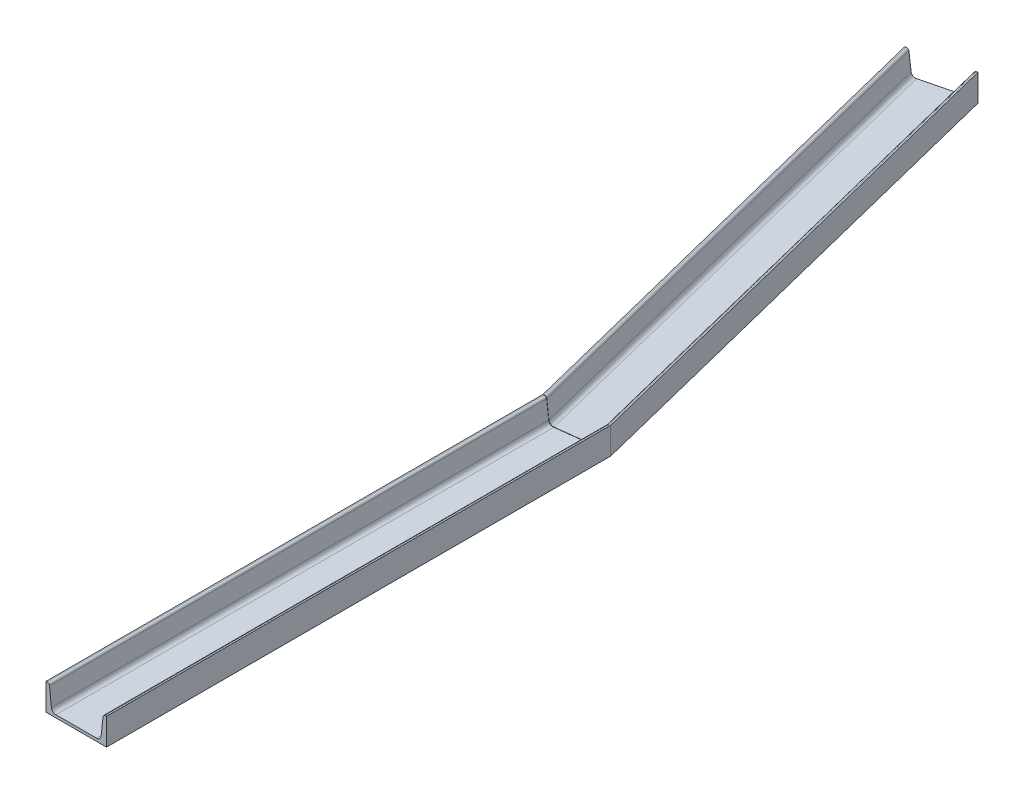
ISO-10303-21;
HEADER;
FILE_DESCRIPTION(('STEP AP214'),'2;1');
FILE_NAME('part.step','',(''),(''),'','','');
FILE_SCHEMA(('AUTOMOTIVE_DESIGN { 1 0 10303 214 1 1 1 1 }'));
ENDSEC;
DATA;
#1=APPLICATION_CONTEXT('core data for automotive mechanical design processes');
#2=APPLICATION_PROTOCOL_DEFINITION('international standard','automotive_design',2000,#1);
#3=PRODUCT_CONTEXT('',#1,'mechanical');
#4=PRODUCT('Part','Part','',(#3));
#5=PRODUCT_RELATED_PRODUCT_CATEGORY('part','',(#4));
#6=PRODUCT_DEFINITION_FORMATION('','',#4);
#7=PRODUCT_DEFINITION_CONTEXT('part definition',#1,'design');
#8=PRODUCT_DEFINITION('design','',#6,#7);
#9=PRODUCT_DEFINITION_SHAPE('','',#8);
#10=(LENGTH_UNIT() NAMED_UNIT(*) SI_UNIT(.MILLI.,.METRE.));
#11=(NAMED_UNIT(*) PLANE_ANGLE_UNIT() SI_UNIT($,.RADIAN.));
#12=(NAMED_UNIT(*) SI_UNIT($,.STERADIAN.) SOLID_ANGLE_UNIT());
#13=UNCERTAINTY_MEASURE_WITH_UNIT(LENGTH_MEASURE(1.E-05),#10,'distance_accuracy_value','');
#14=(GEOMETRIC_REPRESENTATION_CONTEXT(3) GLOBAL_UNCERTAINTY_ASSIGNED_CONTEXT((#13)) GLOBAL_UNIT_ASSIGNED_CONTEXT((#10,
#11,#12)) REPRESENTATION_CONTEXT('',''));
#15=CARTESIAN_POINT('',(0.,0.,0.));
#16=DIRECTION('',(0.,0.,1.));
#17=DIRECTION('',(1.,0.,0.));
#18=AXIS2_PLACEMENT_3D('',#15,#16,#17);
#19=CARTESIAN_POINT('',(-57.5511778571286,53.,1000.));
#20=DIRECTION('',(0.,-1.,0.));
#21=DIRECTION('',(0.,0.,-1.));
#22=AXIS2_PLACEMENT_3D('',#19,#20,#21);
#23=PLANE('',#22);
#24=DIRECTION('',(0.992546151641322,0.,-0.121869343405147));
#25=VECTOR('',#24,1.);
#26=CARTESIAN_POINT('',(-176.796706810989,53.,28.8231022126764));
#27=LINE('',#26,#25);
#28=CARTESIAN_POINT('',(-60.0609346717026,53.,14.4897516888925));
#29=VERTEX_POINT('',#28);
#30=CARTESIAN_POINT('',(-57.612112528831,53.0000000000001,14.1890741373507));
#31=VERTEX_POINT('',#30);
#32=EDGE_CURVE('E258',#29,#31,#27,.T.);
#33=ORIENTED_EDGE('',*,*,#32,.T.);
#34=DIRECTION('',(0.241921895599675,0.,0.970295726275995));
#35=VECTOR('',#34,1.);
#36=CARTESIAN_POINT('',(-295.981301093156,53.0000000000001,-941.857522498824));
#37=LINE('',#36,#35);
#38=CARTESIAN_POINT('',(-295.981301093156,53.0000000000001,-941.857522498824));
#39=VERTEX_POINT('',#38);
#40=EDGE_CURVE('E315',#39,#31,#37,.T.);
#41=ORIENTED_EDGE('',*,*,#40,.F.);
#42=DIRECTION('',(0.970295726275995,0.,-0.241921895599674));
#43=VECTOR('',#42,1.);
#44=CARTESIAN_POINT('',(-295.981301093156,53.0000000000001,-941.857522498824));
#45=LINE('',#44,#43);
#46=CARTESIAN_POINT('',(-298.357382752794,53.0000000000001,-941.265098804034));
#47=VERTEX_POINT('',#46);
#48=EDGE_CURVE('E272',#47,#39,#45,.T.);
#49=ORIENTED_EDGE('',*,*,#48,.F.);
#50=DIRECTION('',(0.241921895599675,0.,0.970295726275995));
#51=VECTOR('',#50,1.);
#52=CARTESIAN_POINT('',(-298.357382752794,53.0000000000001,-941.265098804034));
#53=LINE('',#52,#51);
#54=EDGE_CURVE('E317',#47,#29,#53,.T.);
#55=ORIENTED_EDGE('',*,*,#54,.T.);
#56=EDGE_LOOP('',(#33,#41,#49,#55));
#57=FACE_BOUND('',#56,.T.);
#58=ADVANCED_FACE('F39',(#57),#23,.F.);
#59=CARTESIAN_POINT('',(40.3976442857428,5.5,1000.));
#60=DIRECTION('',(0.,-1.,0.));
#61=DIRECTION('',(1.,0.,0.));
#62=AXIS2_PLACEMENT_3D('',#59,#60,#61);
#63=PLANE('',#62);
#64=DIRECTION('',(0.,0.,-1.));
#65=VECTOR('',#64,1.);
#66=CARTESIAN_POINT('',(40.3976442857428,5.5,1000.));
#67=LINE('',#66,#65);
#68=CARTESIAN_POINT('',(40.3976442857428,5.5,1000.));
#69=VERTEX_POINT('',#68);
#70=CARTESIAN_POINT('',(40.3976442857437,5.5,2.65874409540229));
#71=VERTEX_POINT('',#70);
#72=EDGE_CURVE('E359',#69,#71,#67,.T.);
#73=ORIENTED_EDGE('',*,*,#72,.T.);
#74=DIRECTION('',(-0.992546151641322,0.,0.121869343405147));
#75=VECTOR('',#74,1.);
#76=CARTESIAN_POINT('',(-80.2416993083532,5.49999999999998,17.471392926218));
#77=LINE('',#76,#75);
#78=CARTESIAN_POINT('',(-40.3976442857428,5.49999999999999,12.5791581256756));
#79=VERTEX_POINT('',#78);
#80=EDGE_CURVE('E231',#71,#79,#77,.T.);
#81=ORIENTED_EDGE('',*,*,#80,.T.);
#82=DIRECTION('',(0.,0.,-1.));
#83=VECTOR('',#82,1.);
#84=CARTESIAN_POINT('',(-40.3976442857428,5.49999999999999,1000.));
#85=LINE('',#84,#83);
#86=CARTESIAN_POINT('',(-40.3976442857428,5.49999999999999,1000.));
#87=VERTEX_POINT('',#86);
#88=EDGE_CURVE('E357',#87,#79,#85,.T.);
#89=ORIENTED_EDGE('',*,*,#88,.F.);
#90=DIRECTION('',(-1.,0.,0.));
#91=VECTOR('',#90,1.);
#92=CARTESIAN_POINT('',(40.3976442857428,5.5,1000.));
#93=LINE('',#92,#91);
#94=EDGE_CURVE('E342',#69,#87,#93,.T.);
#95=ORIENTED_EDGE('',*,*,#94,.F.);
#96=EDGE_LOOP('',(#73,#81,#89,#95));
#97=FACE_BOUND('',#96,.T.);
#98=ADVANCED_FACE('F450',(#97),#63,.F.);
#99=DIRECTION('',(0.,0.,-1.));
#100=VECTOR('',#99,1.);
#101=CARTESIAN_POINT('',(-57.5511778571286,53.,1000.));
#102=LINE('',#101,#100);
#103=CARTESIAN_POINT('',(-57.5511778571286,53.,1000.));
#104=VERTEX_POINT('',#103);
#105=CARTESIAN_POINT('',(-57.5511778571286,53.,14.6853472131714));
#106=VERTEX_POINT('',#105);
#107=EDGE_CURVE('E210',#104,#106,#102,.T.);
#108=ORIENTED_EDGE('',*,*,#107,.T.);
#109=DIRECTION('',(-0.992546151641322,0.,0.121869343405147));
#110=VECTOR('',#109,1.);
#111=CARTESIAN_POINT('',(-176.735772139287,53.,29.3193752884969));
#112=LINE('',#111,#110);
#113=CARTESIAN_POINT('',(-60.,53.,14.9860247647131));
#114=VERTEX_POINT('',#113);
#115=EDGE_CURVE('E214',#106,#114,#112,.T.);
#116=ORIENTED_EDGE('',*,*,#115,.T.);
#117=DIRECTION('',(0.,0.,-1.));
#118=VECTOR('',#117,1.);
#119=CARTESIAN_POINT('',(-60.,53.,1000.));
#120=LINE('',#119,#118);
#121=CARTESIAN_POINT('',(-60.,53.,1000.));
#122=VERTEX_POINT('',#121);
#123=EDGE_CURVE('E217',#122,#114,#120,.T.);
#124=ORIENTED_EDGE('',*,*,#123,.F.);
#125=DIRECTION('',(-1.,0.,0.));
#126=VECTOR('',#125,1.);
#127=CARTESIAN_POINT('',(-57.5511778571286,53.,1000.));
#128=LINE('',#127,#126);
#129=EDGE_CURVE('E216',#104,#122,#128,.T.);
#130=ORIENTED_EDGE('',*,*,#129,.F.);
#131=EDGE_LOOP('',(#108,#116,#124,#130));
#132=FACE_BOUND('',#131,.T.);
#133=ADVANCED_FACE('F211',(#132),#23,.F.);
#134=CARTESIAN_POINT('',(-60.,53.,1000.));
#135=DIRECTION('',(1.,0.,0.));
#136=DIRECTION('',(0.,1.,0.));
#137=AXIS2_PLACEMENT_3D('',#134,#135,#136);
#138=PLANE('',#137);
#139=ORIENTED_EDGE('',*,*,#123,.T.);
#140=DIRECTION('',(0.,-1.,0.));
#141=VECTOR('',#140,1.);
#142=CARTESIAN_POINT('',(-60.,53.,14.9860247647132));
#143=LINE('',#142,#141);
#144=CARTESIAN_POINT('',(-60.,0.,14.9860247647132));
#145=VERTEX_POINT('',#144);
#146=EDGE_CURVE('E229',#114,#145,#143,.T.);
#147=ORIENTED_EDGE('',*,*,#146,.T.);
#148=DIRECTION('',(0.,0.,-1.));
#149=VECTOR('',#148,1.);
#150=CARTESIAN_POINT('',(-60.,0.,1000.));
#151=LINE('',#150,#149);
#152=CARTESIAN_POINT('',(-60.,0.,1000.));
#153=VERTEX_POINT('',#152);
#154=EDGE_CURVE('E376',#153,#145,#151,.T.);
#155=ORIENTED_EDGE('',*,*,#154,.F.);
#156=DIRECTION('',(0.,-1.,0.));
#157=VECTOR('',#156,1.);
#158=CARTESIAN_POINT('',(-60.,53.,1000.));
#159=LINE('',#158,#157);
#160=EDGE_CURVE('E327',#122,#153,#159,.T.);
#161=ORIENTED_EDGE('',*,*,#160,.F.);
#162=EDGE_LOOP('',(#139,#147,#155,#161));
#163=FACE_BOUND('',#162,.T.);
#164=ADVANCED_FACE('F41',(#163),#138,.F.);
#165=CARTESIAN_POINT('',(57.5511778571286,48.5,1000.));
#166=DIRECTION('',(0.,0.,-1.));
#167=DIRECTION('',(-1.,0.,0.));
#168=AXIS2_PLACEMENT_3D('',#165,#166,#167);
#169=CYLINDRICAL_SURFACE('',#168,4.5);
#170=DIRECTION('',(0.,0.,-1.));
#171=VECTOR('',#170,1.);
#172=CARTESIAN_POINT('',(57.5511778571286,53.,1000.));
#173=LINE('',#172,#171);
#174=CARTESIAN_POINT('',(57.5511778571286,53.,1000.));
#175=VERTEX_POINT('',#174);
#176=CARTESIAN_POINT('',(57.5511778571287,53.0000000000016,0.300677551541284));
#177=VERTEX_POINT('',#176);
#178=EDGE_CURVE('E368',#175,#177,#173,.T.);
#179=ORIENTED_EDGE('',*,*,#178,.T.);
#180=CARTESIAN_POINT('',(57.5511778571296,48.5,0.300677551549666));
#181=DIRECTION('',(-0.121869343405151,0.,-0.992546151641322));
#182=DIRECTION('',(0.992546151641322,0.,-0.121869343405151));
#183=AXIS2_PLACEMENT_3D('',#180,#181,#182);
#184=ELLIPSE('',#183,4.53379421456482,4.5);
#185=CARTESIAN_POINT('',(55.4758177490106,52.4928536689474,0.555499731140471));
#186=VERTEX_POINT('',#185);
#187=EDGE_CURVE('E323',#186,#177,#184,.T.);
#188=ORIENTED_EDGE('',*,*,#187,.F.);
#189=CARTESIAN_POINT('',(57.5511778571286,48.5,17.4579514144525));
#190=DIRECTION('',(0.992546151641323,0.,-0.121869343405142));
#191=DIRECTION('',(-0.121869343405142,0.,-0.992546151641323));
#192=AXIS2_PLACEMENT_3D('',#189,#190,#191);
#193=ELLIPSE('',#192,36.9247907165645,4.5);
#194=CARTESIAN_POINT('',(55.5062850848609,52.5085425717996,0.803636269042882));
#195=VERTEX_POINT('',#194);
#196=EDGE_CURVE('E264',#186,#195,#193,.T.);
#197=ORIENTED_EDGE('',*,*,#196,.T.);
#198=CARTESIAN_POINT('',(57.5511778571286,48.5,0.552555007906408));
#199=DIRECTION('',(0.121869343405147,0.,0.992546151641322));
#200=DIRECTION('',(0.992546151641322,0.,-0.121869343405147));
#201=AXIS2_PLACEMENT_3D('',#198,#199,#200);
#202=ELLIPSE('',#201,4.53379421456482,4.5);
#203=CARTESIAN_POINT('',(53.0759033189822,48.9710815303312,1.10204962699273));
#204=VERTEX_POINT('',#203);
#205=EDGE_CURVE('E246',#195,#204,#202,.T.);
#206=ORIENTED_EDGE('',*,*,#205,.T.);
#207=DIRECTION('',(0.,0.,-1.));
#208=VECTOR('',#207,1.);
#209=CARTESIAN_POINT('',(53.0759033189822,48.9710815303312,1000.));
#210=LINE('',#209,#208);
#211=CARTESIAN_POINT('',(53.0759033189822,48.9710815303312,1000.));
#212=VERTEX_POINT('',#211);
#213=EDGE_CURVE('E365',#212,#204,#210,.T.);
#214=ORIENTED_EDGE('',*,*,#213,.F.);
#215=CARTESIAN_POINT('',(57.5511778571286,48.5,1000.));
#216=DIRECTION('',(0.,0.,1.));
#217=DIRECTION('',(1.,0.,0.));
#218=AXIS2_PLACEMENT_3D('',#215,#216,#217);
#219=CIRCLE('',#218,4.5);
#220=EDGE_CURVE('E336',#175,#212,#219,.T.);
#221=ORIENTED_EDGE('',*,*,#220,.F.);
#222=EDGE_LOOP('',(#179,#188,#197,#206,#214,#221));
#223=FACE_BOUND('',#222,.T.);
#224=ADVANCED_FACE('F462',(#223),#169,.T.);
#225=CARTESIAN_POINT('',(53.0759033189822,48.9710815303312,1000.));
#226=DIRECTION('',(0.994505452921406,-0.104684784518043,0.));
#227=DIRECTION('',(0.104684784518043,0.994505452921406,0.));
#228=AXIS2_PLACEMENT_3D('',#225,#226,#227);
#229=PLANE('',#228);
#230=ORIENTED_EDGE('',*,*,#213,.T.);
#231=DIRECTION('',(-0.104676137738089,-0.994423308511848,0.0128526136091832));
#232=VECTOR('',#231,1.);
#233=CARTESIAN_POINT('',(51.7320240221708,36.2042282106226,1.26705725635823));
#234=LINE('',#233,#232);
#235=CARTESIAN_POINT('',(49.3481933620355,13.5578369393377,1.55975485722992));
#236=VERTEX_POINT('',#235);
#237=EDGE_CURVE('E243',#204,#236,#234,.T.);
#238=ORIENTED_EDGE('',*,*,#237,.T.);
#239=DIRECTION('',(0.,0.,-1.));
#240=VECTOR('',#239,1.);
#241=CARTESIAN_POINT('',(49.3481933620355,13.5578369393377,1000.));
#242=LINE('',#241,#240);
#243=CARTESIAN_POINT('',(49.3481933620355,13.5578369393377,1000.));
#244=VERTEX_POINT('',#243);
#245=EDGE_CURVE('E362',#244,#236,#242,.T.);
#246=ORIENTED_EDGE('',*,*,#245,.F.);
#247=DIRECTION('',(-0.104684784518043,-0.994505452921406,0.));
#248=VECTOR('',#247,1.);
#249=CARTESIAN_POINT('',(53.0759033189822,48.9710815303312,1000.));
#250=LINE('',#249,#248);
#251=EDGE_CURVE('E338',#212,#244,#250,.T.);
#252=ORIENTED_EDGE('',*,*,#251,.F.);
#253=EDGE_LOOP('',(#230,#238,#246,#252));
#254=FACE_BOUND('',#253,.T.);
#255=ADVANCED_FACE('F457',(#254),#229,.F.);
#256=CARTESIAN_POINT('',(40.3976442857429,14.5,1000.));
#257=DIRECTION('',(0.,0.,-1.));
#258=DIRECTION('',(-1.,0.,0.));
#259=AXIS2_PLACEMENT_3D('',#256,#257,#258);
#260=CYLINDRICAL_SURFACE('',#259,9.);
#261=ORIENTED_EDGE('',*,*,#245,.T.);
#262=CARTESIAN_POINT('',(40.3976442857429,14.5,2.65874409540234));
#263=DIRECTION('',(0.121869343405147,0.,0.992546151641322));
#264=DIRECTION('',(0.992546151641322,0.,-0.121869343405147));
#265=AXIS2_PLACEMENT_3D('',#262,#263,#264);
#266=ELLIPSE('',#265,9.06758842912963,9.);
#267=EDGE_CURVE('E235',#236,#71,#266,.F.);
#268=ORIENTED_EDGE('',*,*,#267,.T.);
#269=ORIENTED_EDGE('',*,*,#72,.F.);
#270=CARTESIAN_POINT('',(40.3976442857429,14.5,1000.));
#271=DIRECTION('',(0.,0.,-1.));
#272=DIRECTION('',(-1.,0.,0.));
#273=AXIS2_PLACEMENT_3D('',#270,#271,#272);
#274=CIRCLE('',#273,9.);
#275=EDGE_CURVE('E340',#244,#69,#274,.T.);
#276=ORIENTED_EDGE('',*,*,#275,.F.);
#277=EDGE_LOOP('',(#261,#268,#269,#276));
#278=FACE_BOUND('',#277,.T.);
#279=ADVANCED_FACE('F454',(#278),#260,.F.);
#280=CARTESIAN_POINT('',(-57.5511778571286,48.5,1000.));
#281=DIRECTION('',(0.,0.,-1.));
#282=DIRECTION('',(-1.,0.,0.));
#283=AXIS2_PLACEMENT_3D('',#280,#281,#282);
#284=CYLINDRICAL_SURFACE('',#283,4.5);
#285=CARTESIAN_POINT('',(-57.5511778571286,48.5,14.6853472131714));
#286=DIRECTION('',(0.121869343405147,0.,0.992546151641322));
#287=DIRECTION('',(-0.992546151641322,0.,0.121869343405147));
#288=AXIS2_PLACEMENT_3D('',#285,#286,#287);
#289=ELLIPSE('',#288,4.53379421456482,4.5);
#290=CARTESIAN_POINT('',(-53.0759033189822,48.9710815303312,14.1358525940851));
#291=VERTEX_POINT('',#290);
#292=EDGE_CURVE('E220',#291,#106,#289,.T.);
#293=ORIENTED_EDGE('',*,*,#292,.T.);
#294=ORIENTED_EDGE('',*,*,#107,.F.);
#295=CARTESIAN_POINT('',(-57.5511778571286,48.5,1000.));
#296=DIRECTION('',(0.,0.,1.));
#297=DIRECTION('',(1.,0.,0.));
#298=AXIS2_PLACEMENT_3D('',#295,#296,#297);
#299=CIRCLE('',#298,4.5);
#300=CARTESIAN_POINT('',(-53.0759033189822,48.9710815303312,1000.));
#301=VERTEX_POINT('',#300);
#302=EDGE_CURVE('E348',#301,#104,#299,.T.);
#303=ORIENTED_EDGE('',*,*,#302,.F.);
#304=DIRECTION('',(0.,0.,-1.));
#305=VECTOR('',#304,1.);
#306=CARTESIAN_POINT('',(-53.0759033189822,48.9710815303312,1000.));
#307=LINE('',#306,#305);
#308=EDGE_CURVE('E54',#301,#291,#307,.T.);
#309=ORIENTED_EDGE('',*,*,#308,.T.);
#310=EDGE_LOOP('',(#293,#294,#303,#309));
#311=FACE_BOUND('',#310,.T.);
#312=ADVANCED_FACE('F221',(#311),#284,.T.);
#313=CARTESIAN_POINT('',(-60.,0.,1000.));
#314=DIRECTION('',(0.,1.,0.));
#315=DIRECTION('',(-1.,0.,0.));
#316=AXIS2_PLACEMENT_3D('',#313,#314,#315);
#317=PLANE('',#316);
#318=ORIENTED_EDGE('',*,*,#154,.T.);
#319=DIRECTION('',(-0.992546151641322,0.,0.121869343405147));
#320=VECTOR('',#319,1.);
#321=CARTESIAN_POINT('',(-77.831531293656,0.,17.1754615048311));
#322=LINE('',#321,#320);
#323=CARTESIAN_POINT('',(55.5062850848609,0.,0.803636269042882));
#324=VERTEX_POINT('',#323);
#325=EDGE_CURVE('E424',#324,#145,#322,.T.);
#326=ORIENTED_EDGE('',*,*,#325,.F.);
#327=DIRECTION('',(0.121869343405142,0.,0.992546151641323));
#328=VECTOR('',#327,1.);
#329=CARTESIAN_POINT('',(55.5062850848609,0.,0.803636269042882));
#330=LINE('',#329,#328);
#331=CARTESIAN_POINT('',(55.4453504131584,0.,0.307363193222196));
#332=VERTEX_POINT('',#331);
#333=EDGE_CURVE('E421',#332,#324,#330,.T.);
#334=ORIENTED_EDGE('',*,*,#333,.F.);
#335=DIRECTION('',(0.992546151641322,0.,-0.121869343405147));
#336=VECTOR('',#335,1.);
#337=CARTESIAN_POINT('',(55.4453504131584,0.,0.307363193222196));
#338=LINE('',#337,#336);
#339=CARTESIAN_POINT('',(-60.0609346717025,0.,14.4897516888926));
#340=VERTEX_POINT('',#339);
#341=EDGE_CURVE('E419',#340,#332,#338,.T.);
#342=ORIENTED_EDGE('',*,*,#341,.F.);
#343=DIRECTION('',(0.241921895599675,0.,0.970295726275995));
#344=VECTOR('',#343,1.);
#345=CARTESIAN_POINT('',(-298.357382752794,0.,-941.265098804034));
#346=LINE('',#345,#344);
#347=CARTESIAN_POINT('',(-298.357382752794,0.,-941.265098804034));
#348=VERTEX_POINT('',#347);
#349=EDGE_CURVE('E320',#348,#340,#346,.T.);
#350=ORIENTED_EDGE('',*,*,#349,.F.);
#351=DIRECTION('',(-0.970295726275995,0.,0.241921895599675));
#352=VECTOR('',#351,1.);
#353=CARTESIAN_POINT('',(-298.357382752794,0.,-941.265098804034));
#354=LINE('',#353,#352);
#355=CARTESIAN_POINT('',(-181.921895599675,0.,-970.295726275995));
#356=VERTEX_POINT('',#355);
#357=EDGE_CURVE('E267',#356,#348,#354,.T.);
#358=ORIENTED_EDGE('',*,*,#357,.F.);
#359=DIRECTION('',(0.241921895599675,0.,0.970295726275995));
#360=VECTOR('',#359,1.);
#361=CARTESIAN_POINT('',(-181.921895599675,0.,-970.295726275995));
#362=LINE('',#361,#360);
#363=CARTESIAN_POINT('',(60.0000000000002,0.,0.));
#364=VERTEX_POINT('',#363);
#365=EDGE_CURVE('E293',#356,#364,#362,.T.);
#366=ORIENTED_EDGE('',*,*,#365,.T.);
#367=DIRECTION('',(0.,0.,-1.));
#368=VECTOR('',#367,1.);
#369=CARTESIAN_POINT('',(60.,0.,1000.));
#370=LINE('',#369,#368);
#371=CARTESIAN_POINT('',(60.,0.,1000.));
#372=VERTEX_POINT('',#371);
#373=EDGE_CURVE('E373',#372,#364,#370,.T.);
#374=ORIENTED_EDGE('',*,*,#373,.F.);
#375=DIRECTION('',(1.,0.,0.));
#376=VECTOR('',#375,1.);
#377=CARTESIAN_POINT('',(-60.,0.,1000.));
#378=LINE('',#377,#376);
#379=EDGE_CURVE('E330',#153,#372,#378,.T.);
#380=ORIENTED_EDGE('',*,*,#379,.F.);
#381=EDGE_LOOP('',(#318,#326,#334,#342,#350,#358,#366,#374,#380));
#382=FACE_BOUND('',#381,.T.);
#383=ADVANCED_FACE('F433',(#382),#317,.F.);
#384=CARTESIAN_POINT('',(60.,0.,1000.));
#385=DIRECTION('',(-1.,0.,0.));
#386=DIRECTION('',(0.,-1.,0.));
#387=AXIS2_PLACEMENT_3D('',#384,#385,#386);
#388=PLANE('',#387);
#389=DIRECTION('',(0.,1.,0.));
#390=VECTOR('',#389,1.);
#391=CARTESIAN_POINT('',(60.,0.,0.));
#392=LINE('',#391,#390);
#393=CARTESIAN_POINT('',(60.,53.,0.));
#394=VERTEX_POINT('',#393);
#395=EDGE_CURVE('E326',#364,#394,#392,.T.);
#396=ORIENTED_EDGE('',*,*,#395,.T.);
#397=DIRECTION('',(0.,0.,-1.));
#398=VECTOR('',#397,1.);
#399=CARTESIAN_POINT('',(60.,53.,1000.));
#400=LINE('',#399,#398);
#401=CARTESIAN_POINT('',(60.,53.,1000.));
#402=VERTEX_POINT('',#401);
#403=EDGE_CURVE('E370',#402,#394,#400,.T.);
#404=ORIENTED_EDGE('',*,*,#403,.F.);
#405=DIRECTION('',(0.,1.,0.));
#406=VECTOR('',#405,1.);
#407=CARTESIAN_POINT('',(60.,0.,1000.));
#408=LINE('',#407,#406);
#409=EDGE_CURVE('E332',#372,#402,#408,.T.);
#410=ORIENTED_EDGE('',*,*,#409,.F.);
#411=ORIENTED_EDGE('',*,*,#373,.T.);
#412=EDGE_LOOP('',(#396,#404,#410,#411));
#413=FACE_BOUND('',#412,.T.);
#414=ADVANCED_FACE('F523',(#413),#388,.F.);
#415=CARTESIAN_POINT('',(60.,53.,1000.));
#416=DIRECTION('',(0.,-1.,0.));
#417=DIRECTION('',(0.,0.,-1.));
#418=AXIS2_PLACEMENT_3D('',#415,#416,#417);
#419=PLANE('',#418);
#420=DIRECTION('',(0.241921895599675,0.,0.970295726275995));
#421=VECTOR('',#420,1.);
#422=CARTESIAN_POINT('',(-184.297977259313,53.,-969.703302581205));
#423=LINE('',#422,#421);
#424=CARTESIAN_POINT('',(-184.297977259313,53.,-969.703302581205));
#425=VERTEX_POINT('',#424);
#426=EDGE_CURVE('E298',#425,#177,#423,.T.);
#427=ORIENTED_EDGE('',*,*,#426,.T.);
#428=ORIENTED_EDGE('',*,*,#178,.F.);
#429=DIRECTION('',(-1.,0.,0.));
#430=VECTOR('',#429,1.);
#431=CARTESIAN_POINT('',(60.,53.,1000.));
#432=LINE('',#431,#430);
#433=EDGE_CURVE('E334',#402,#175,#432,.T.);
#434=ORIENTED_EDGE('',*,*,#433,.F.);
#435=ORIENTED_EDGE('',*,*,#403,.T.);
#436=DIRECTION('',(0.241921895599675,0.,0.970295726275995));
#437=VECTOR('',#436,1.);
#438=CARTESIAN_POINT('',(-181.921895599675,53.,-970.295726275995));
#439=LINE('',#438,#437);
#440=CARTESIAN_POINT('',(-181.921895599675,53.,-970.295726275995));
#441=VERTEX_POINT('',#440);
#442=EDGE_CURVE('E296',#441,#394,#439,.T.);
#443=ORIENTED_EDGE('',*,*,#442,.F.);
#444=DIRECTION('',(0.970295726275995,0.,-0.241921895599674));
#445=VECTOR('',#444,1.);
#446=CARTESIAN_POINT('',(-181.921895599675,53.,-970.295726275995));
#447=LINE('',#446,#445);
#448=EDGE_CURVE('E289',#425,#441,#447,.T.);
#449=ORIENTED_EDGE('',*,*,#448,.F.);
#450=EDGE_LOOP('',(#427,#428,#434,#435,#443,#449));
#451=FACE_BOUND('',#450,.T.);
#452=ADVANCED_FACE('F468',(#451),#419,.F.);
#453=DIRECTION('',(0.241921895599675,0.,0.970295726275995));
#454=VECTOR('',#453,1.);
#455=CARTESIAN_POINT('',(-279.337300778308,5.50000000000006,-946.007337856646));
#456=LINE('',#455,#454);
#457=CARTESIAN_POINT('',(-279.337300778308,5.50000000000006,-946.007337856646));
#458=VERTEX_POINT('',#457);
#459=CARTESIAN_POINT('',(-40.4585789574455,5.50000000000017,12.0828850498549));
#460=VERTEX_POINT('',#459);
#461=EDGE_CURVE('E62',#458,#460,#456,.T.);
#462=ORIENTED_EDGE('',*,*,#461,.T.);
#463=DIRECTION('',(0.992546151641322,0.,-0.121869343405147));
#464=VECTOR('',#463,1.);
#465=CARTESIAN_POINT('',(-80.3026339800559,5.49999999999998,16.9751198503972));
#466=LINE('',#465,#464);
#467=CARTESIAN_POINT('',(40.3367096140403,5.50000000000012,2.16247101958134));
#468=VERTEX_POINT('',#467);
#469=EDGE_CURVE('E256',#460,#468,#466,.T.);
#470=ORIENTED_EDGE('',*,*,#469,.T.);
#471=DIRECTION('',(0.241921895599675,0.,0.970295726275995));
#472=VECTOR('',#471,1.);
#473=CARTESIAN_POINT('',(-200.94197757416,5.50000000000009,-965.553487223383));
#474=LINE('',#473,#472);
#475=CARTESIAN_POINT('',(-200.94197757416,5.50000000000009,-965.553487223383));
#476=VERTEX_POINT('',#475);
#477=EDGE_CURVE('E307',#476,#468,#474,.T.);
#478=ORIENTED_EDGE('',*,*,#477,.F.);
#479=DIRECTION('',(0.970295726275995,0.,-0.241921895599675));
#480=VECTOR('',#479,1.);
#481=CARTESIAN_POINT('',(-200.94197757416,5.5000000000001,-965.553487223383));
#482=LINE('',#481,#480);
#483=EDGE_CURVE('E280',#458,#476,#482,.T.);
#484=ORIENTED_EDGE('',*,*,#483,.F.);
#485=EDGE_LOOP('',(#462,#470,#478,#484));
#486=FACE_BOUND('',#485,.T.);
#487=ADVANCED_FACE('F398',(#486),#63,.F.);
#488=CARTESIAN_POINT('',(-40.3976442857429,14.5,1000.));
#489=DIRECTION('',(0.,0.,-1.));
#490=DIRECTION('',(-1.,0.,0.));
#491=AXIS2_PLACEMENT_3D('',#488,#489,#490);
#492=CYLINDRICAL_SURFACE('',#491,9.);
#493=ORIENTED_EDGE('',*,*,#88,.T.);
#494=CARTESIAN_POINT('',(-40.3976442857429,14.5,12.5791581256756));
#495=DIRECTION('',(0.121869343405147,0.,0.992546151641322));
#496=DIRECTION('',(-0.992546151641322,0.,0.121869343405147));
#497=AXIS2_PLACEMENT_3D('',#494,#495,#496);
#498=ELLIPSE('',#497,9.06758842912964,9.);
#499=CARTESIAN_POINT('',(-49.3481933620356,13.5578369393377,13.678147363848));
#500=VERTEX_POINT('',#499);
#501=EDGE_CURVE('E409',#79,#500,#498,.F.);
#502=ORIENTED_EDGE('',*,*,#501,.T.);
#503=DIRECTION('',(0.,0.,-1.));
#504=VECTOR('',#503,1.);
#505=CARTESIAN_POINT('',(-49.3481933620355,13.5578369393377,1000.));
#506=LINE('',#505,#504);
#507=CARTESIAN_POINT('',(-49.3481933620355,13.5578369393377,1000.));
#508=VERTEX_POINT('',#507);
#509=EDGE_CURVE('E355',#508,#500,#506,.T.);
#510=ORIENTED_EDGE('',*,*,#509,.F.);
#511=CARTESIAN_POINT('',(-40.3976442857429,14.5,1000.));
#512=DIRECTION('',(0.,0.,-1.));
#513=DIRECTION('',(-1.,0.,0.));
#514=AXIS2_PLACEMENT_3D('',#511,#512,#513);
#515=CIRCLE('',#514,9.);
#516=EDGE_CURVE('E344',#87,#508,#515,.T.);
#517=ORIENTED_EDGE('',*,*,#516,.F.);
#518=EDGE_LOOP('',(#493,#502,#510,#517));
#519=FACE_BOUND('',#518,.T.);
#520=ADVANCED_FACE('F446',(#519),#492,.F.);
#521=CARTESIAN_POINT('',(-49.3481933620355,13.5578369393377,1000.));
#522=DIRECTION('',(-0.994505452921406,-0.104684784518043,0.));
#523=DIRECTION('',(0.104684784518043,-0.994505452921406,0.));
#524=AXIS2_PLACEMENT_3D('',#521,#522,#523);
#525=PLANE('',#524);
#526=ORIENTED_EDGE('',*,*,#509,.T.);
#527=DIRECTION('',(-0.104676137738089,0.994423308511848,0.0128526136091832));
#528=VECTOR('',#527,1.);
#529=CARTESIAN_POINT('',(-49.1718903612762,11.8829584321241,13.6565000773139));
#530=LINE('',#529,#528);
#531=EDGE_CURVE('E224',#500,#291,#530,.T.);
#532=ORIENTED_EDGE('',*,*,#531,.T.);
#533=ORIENTED_EDGE('',*,*,#308,.F.);
#534=DIRECTION('',(-0.104684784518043,0.994505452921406,0.));
#535=VECTOR('',#534,1.);
#536=CARTESIAN_POINT('',(-49.3481933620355,13.5578369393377,1000.));
#537=LINE('',#536,#535);
#538=EDGE_CURVE('E346',#508,#301,#537,.T.);
#539=ORIENTED_EDGE('',*,*,#538,.F.);
#540=EDGE_LOOP('',(#526,#532,#533,#539));
#541=FACE_BOUND('',#540,.T.);
#542=ADVANCED_FACE('F444',(#541),#525,.F.);
#543=CARTESIAN_POINT('',(57.5511778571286,48.5,1000.));
#544=DIRECTION('',(0.,0.,1.));
#545=DIRECTION('',(1.,0.,0.));
#546=AXIS2_PLACEMENT_3D('',#543,#544,#545);
#547=PLANE('',#546);
#548=ORIENTED_EDGE('',*,*,#160,.T.);
#549=ORIENTED_EDGE('',*,*,#379,.T.);
#550=ORIENTED_EDGE('',*,*,#409,.T.);
#551=ORIENTED_EDGE('',*,*,#433,.T.);
#552=ORIENTED_EDGE('',*,*,#220,.T.);
#553=ORIENTED_EDGE('',*,*,#251,.T.);
#554=ORIENTED_EDGE('',*,*,#275,.T.);
#555=ORIENTED_EDGE('',*,*,#94,.T.);
#556=ORIENTED_EDGE('',*,*,#516,.T.);
#557=ORIENTED_EDGE('',*,*,#538,.T.);
#558=ORIENTED_EDGE('',*,*,#302,.T.);
#559=ORIENTED_EDGE('',*,*,#129,.T.);
#560=EDGE_LOOP('',(#548,#549,#550,#551,#552,#553,#554,#555,#556,#557,#558,#559));
#561=FACE_BOUND('',#560,.T.);
#562=ADVANCED_FACE('F439',(#561),#547,.T.);
#563=CARTESIAN_POINT('',(-184.297977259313,48.5,-969.703302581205));
#564=DIRECTION('',(0.241921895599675,0.,0.970295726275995));
#565=DIRECTION('',(0.970295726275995,0.,-0.241921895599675));
#566=AXIS2_PLACEMENT_3D('',#563,#564,#565);
#567=PLANE('',#566);
#568=ORIENTED_EDGE('',*,*,#357,.T.);
#569=DIRECTION('',(0.,1.,0.));
#570=VECTOR('',#569,1.);
#571=CARTESIAN_POINT('',(-298.357382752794,53.0000000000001,-941.265098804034));
#572=LINE('',#571,#570);
#573=EDGE_CURVE('E270',#348,#47,#572,.T.);
#574=ORIENTED_EDGE('',*,*,#573,.T.);
#575=ORIENTED_EDGE('',*,*,#48,.T.);
#576=CARTESIAN_POINT('',(-295.981301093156,48.5000000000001,-941.857522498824));
#577=DIRECTION('',(-0.241921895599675,0.,-0.970295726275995));
#578=DIRECTION('',(0.970295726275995,0.,-0.241921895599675));
#579=AXIS2_PLACEMENT_3D('',#576,#577,#578);
#580=CIRCLE('',#579,4.5);
#581=CARTESIAN_POINT('',(-291.638961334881,48.9710815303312,-942.940189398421));
#582=VERTEX_POINT('',#581);
#583=EDGE_CURVE('E274',#39,#582,#580,.T.);
#584=ORIENTED_EDGE('',*,*,#583,.T.);
#585=DIRECTION('',(0.101575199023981,-0.994505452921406,-0.0253255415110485));
#586=VECTOR('',#585,1.);
#587=CARTESIAN_POINT('',(-288.021980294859,13.5578369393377,-943.842004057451));
#588=LINE('',#587,#586);
#589=CARTESIAN_POINT('',(-288.021980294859,13.5578369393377,-943.842004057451));
#590=VERTEX_POINT('',#589);
#591=EDGE_CURVE('E276',#582,#590,#588,.T.);
#592=ORIENTED_EDGE('',*,*,#591,.T.);
#593=CARTESIAN_POINT('',(-279.337300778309,14.5000000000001,-946.007337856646));
#594=DIRECTION('',(0.241921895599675,0.,0.970295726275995));
#595=DIRECTION('',(-0.970295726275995,0.,0.241921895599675));
#596=AXIS2_PLACEMENT_3D('',#593,#594,#595);
#597=CIRCLE('',#596,9.);
#598=EDGE_CURVE('E278',#590,#458,#597,.T.);
#599=ORIENTED_EDGE('',*,*,#598,.T.);
#600=ORIENTED_EDGE('',*,*,#483,.T.);
#601=CARTESIAN_POINT('',(-200.94197757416,14.5000000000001,-965.553487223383));
#602=DIRECTION('',(0.241921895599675,0.,0.970295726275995));
#603=DIRECTION('',(-0.970295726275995,0.,0.241921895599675));
#604=AXIS2_PLACEMENT_3D('',#601,#602,#603);
#605=CIRCLE('',#604,9.);
#606=CARTESIAN_POINT('',(-192.25729805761,13.5578369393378,-967.718821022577));
#607=VERTEX_POINT('',#606);
#608=EDGE_CURVE('E283',#476,#607,#605,.T.);
#609=ORIENTED_EDGE('',*,*,#608,.T.);
#610=DIRECTION('',(0.10157519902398,0.994505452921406,-0.0253255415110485));
#611=VECTOR('',#610,1.);
#612=CARTESIAN_POINT('',(-188.640317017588,48.9710815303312,-968.620635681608));
#613=LINE('',#612,#611);
#614=CARTESIAN_POINT('',(-188.640317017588,48.9710815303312,-968.620635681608));
#615=VERTEX_POINT('',#614);
#616=EDGE_CURVE('E285',#607,#615,#613,.T.);
#617=ORIENTED_EDGE('',*,*,#616,.T.);
#618=CARTESIAN_POINT('',(-184.297977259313,48.5,-969.703302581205));
#619=DIRECTION('',(-0.241921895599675,0.,-0.970295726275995));
#620=DIRECTION('',(0.970295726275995,0.,-0.241921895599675));
#621=AXIS2_PLACEMENT_3D('',#618,#619,#620);
#622=CIRCLE('',#621,4.5);
#623=EDGE_CURVE('E287',#615,#425,#622,.T.);
#624=ORIENTED_EDGE('',*,*,#623,.T.);
#625=ORIENTED_EDGE('',*,*,#448,.T.);
#626=DIRECTION('',(0.,-1.,0.));
#627=VECTOR('',#626,1.);
#628=CARTESIAN_POINT('',(-181.921895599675,0.,-970.295726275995));
#629=LINE('',#628,#627);
#630=EDGE_CURVE('E291',#441,#356,#629,.T.);
#631=ORIENTED_EDGE('',*,*,#630,.T.);
#632=EDGE_LOOP('',(#568,#574,#575,#584,#592,#599,#600,#609,#617,#624,#625,#631));
#633=FACE_BOUND('',#632,.T.);
#634=ADVANCED_FACE('F400',(#633),#567,.F.);
#635=CARTESIAN_POINT('',(-181.921895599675,0.,-970.295726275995));
#636=DIRECTION('',(-0.970295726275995,0.,0.241921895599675));
#637=DIRECTION('',(0.241921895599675,0.,0.970295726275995));
#638=AXIS2_PLACEMENT_3D('',#635,#636,#637);
#639=PLANE('',#638);
#640=ORIENTED_EDGE('',*,*,#395,.F.);
#641=ORIENTED_EDGE('',*,*,#365,.F.);
#642=ORIENTED_EDGE('',*,*,#630,.F.);
#643=ORIENTED_EDGE('',*,*,#442,.T.);
#644=EDGE_LOOP('',(#640,#641,#642,#643));
#645=FACE_BOUND('',#644,.T.);
#646=ADVANCED_FACE('F473',(#645),#639,.F.);
#647=CARTESIAN_POINT('',(-200.94197757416,14.5000000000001,-965.553487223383));
#648=DIRECTION('',(0.241921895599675,0.,0.970295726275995));
#649=DIRECTION('',(0.970295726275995,0.,-0.241921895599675));
#650=AXIS2_PLACEMENT_3D('',#647,#648,#649);
#651=CYLINDRICAL_SURFACE('',#650,9.);
#652=ORIENTED_EDGE('',*,*,#477,.T.);
#653=CARTESIAN_POINT('',(40.3367096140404,14.5000000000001,2.16247101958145));
#654=DIRECTION('',(-0.121869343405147,0.,-0.992546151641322));
#655=DIRECTION('',(0.992546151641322,0.,-0.121869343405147));
#656=AXIS2_PLACEMENT_3D('',#653,#654,#655);
#657=ELLIPSE('',#656,9.06758842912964,9.);
#658=CARTESIAN_POINT('',(49.2872586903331,13.5578369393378,1.06348178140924));
#659=VERTEX_POINT('',#658);
#660=EDGE_CURVE('E253',#468,#659,#657,.F.);
#661=ORIENTED_EDGE('',*,*,#660,.T.);
#662=DIRECTION('',(0.241921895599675,0.,0.970295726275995));
#663=VECTOR('',#662,1.);
#664=CARTESIAN_POINT('',(-192.25729805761,13.5578369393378,-967.718821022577));
#665=LINE('',#664,#663);
#666=EDGE_CURVE('E304',#607,#659,#665,.T.);
#667=ORIENTED_EDGE('',*,*,#666,.F.);
#668=ORIENTED_EDGE('',*,*,#608,.F.);
#669=EDGE_LOOP('',(#652,#661,#667,#668));
#670=FACE_BOUND('',#669,.T.);
#671=ADVANCED_FACE('F395',(#670),#651,.F.);
#672=CARTESIAN_POINT('',(-279.337300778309,14.5000000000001,-946.007337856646));
#673=DIRECTION('',(0.241921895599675,0.,0.970295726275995));
#674=DIRECTION('',(0.970295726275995,0.,-0.241921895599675));
#675=AXIS2_PLACEMENT_3D('',#672,#673,#674);
#676=CYLINDRICAL_SURFACE('',#675,9.);
#677=DIRECTION('',(0.241921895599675,0.,0.970295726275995));
#678=VECTOR('',#677,1.);
#679=CARTESIAN_POINT('',(-288.021980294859,13.5578369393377,-943.842004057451));
#680=LINE('',#679,#678);
#681=CARTESIAN_POINT('',(-49.4091280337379,13.5578369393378,13.1818742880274));
#682=VERTEX_POINT('',#681);
#683=EDGE_CURVE('E311',#590,#682,#680,.T.);
#684=ORIENTED_EDGE('',*,*,#683,.T.);
#685=CARTESIAN_POINT('',(-40.4585789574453,14.5000000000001,12.0828850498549));
#686=DIRECTION('',(-0.121869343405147,0.,-0.992546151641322));
#687=DIRECTION('',(-0.992546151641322,0.,0.121869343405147));
#688=AXIS2_PLACEMENT_3D('',#685,#686,#687);
#689=ELLIPSE('',#688,9.06758842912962,8.99999999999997);
#690=EDGE_CURVE('E406',#682,#460,#689,.F.);
#691=ORIENTED_EDGE('',*,*,#690,.T.);
#692=ORIENTED_EDGE('',*,*,#461,.F.);
#693=ORIENTED_EDGE('',*,*,#598,.F.);
#694=EDGE_LOOP('',(#684,#691,#692,#693));
#695=FACE_BOUND('',#694,.T.);
#696=ADVANCED_FACE('F405',(#695),#676,.F.);
#697=CARTESIAN_POINT('',(-288.021980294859,13.5578369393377,-943.842004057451));
#698=DIRECTION('',(-0.964964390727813,-0.104684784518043,0.24059264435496));
#699=DIRECTION('',(0.241921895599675,0.,0.970295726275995));
#700=AXIS2_PLACEMENT_3D('',#697,#698,#699);
#701=PLANE('',#700);
#702=DIRECTION('',(0.241921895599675,0.,0.970295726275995));
#703=VECTOR('',#702,1.);
#704=CARTESIAN_POINT('',(-291.638961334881,48.9710815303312,-942.940189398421));
#705=LINE('',#704,#703);
#706=CARTESIAN_POINT('',(-53.1368379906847,48.9710815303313,13.6395795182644));
#707=VERTEX_POINT('',#706);
#708=EDGE_CURVE('E313',#582,#707,#705,.T.);
#709=ORIENTED_EDGE('',*,*,#708,.T.);
#710=DIRECTION('',(0.10467613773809,-0.994423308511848,-0.0128526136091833));
#711=VECTOR('',#710,1.);
#712=CARTESIAN_POINT('',(-52.9599192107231,47.2903531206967,13.6178566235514));
#713=LINE('',#712,#711);
#714=EDGE_CURVE('E408',#707,#682,#713,.T.);
#715=ORIENTED_EDGE('',*,*,#714,.T.);
#716=ORIENTED_EDGE('',*,*,#683,.F.);
#717=ORIENTED_EDGE('',*,*,#591,.F.);
#718=EDGE_LOOP('',(#709,#715,#716,#717));
#719=FACE_BOUND('',#718,.T.);
#720=ADVANCED_FACE('F486',(#719),#701,.F.);
#721=CARTESIAN_POINT('',(-295.981301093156,48.5000000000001,-941.857522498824));
#722=DIRECTION('',(0.241921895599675,0.,0.970295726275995));
#723=DIRECTION('',(0.970295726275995,0.,-0.241921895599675));
#724=AXIS2_PLACEMENT_3D('',#721,#722,#723);
#725=CYLINDRICAL_SURFACE('',#724,4.5);
#726=ORIENTED_EDGE('',*,*,#40,.T.);
#727=CARTESIAN_POINT('',(-57.612112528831,48.5000000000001,14.1890741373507));
#728=DIRECTION('',(-0.121869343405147,0.,-0.992546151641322));
#729=DIRECTION('',(-0.992546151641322,0.,0.121869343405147));
#730=AXIS2_PLACEMENT_3D('',#727,#728,#729);
#731=ELLIPSE('',#730,4.53379421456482,4.5);
#732=EDGE_CURVE('E411',#31,#707,#731,.T.);
#733=ORIENTED_EDGE('',*,*,#732,.T.);
#734=ORIENTED_EDGE('',*,*,#708,.F.);
#735=ORIENTED_EDGE('',*,*,#583,.F.);
#736=EDGE_LOOP('',(#726,#733,#734,#735));
#737=FACE_BOUND('',#736,.T.);
#738=ADVANCED_FACE('F484',(#737),#725,.T.);
#739=CARTESIAN_POINT('',(-298.357382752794,53.0000000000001,-941.265098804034));
#740=DIRECTION('',(0.970295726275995,0.,-0.241921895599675));
#741=DIRECTION('',(-0.241921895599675,0.,-0.970295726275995));
#742=AXIS2_PLACEMENT_3D('',#739,#740,#741);
#743=PLANE('',#742);
#744=ORIENTED_EDGE('',*,*,#349,.T.);
#745=DIRECTION('',(0.,1.,0.));
#746=VECTOR('',#745,1.);
#747=CARTESIAN_POINT('',(-60.0609346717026,53.0000000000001,14.4897516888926));
#748=LINE('',#747,#746);
#749=EDGE_CURVE('E261',#340,#29,#748,.T.);
#750=ORIENTED_EDGE('',*,*,#749,.T.);
#751=ORIENTED_EDGE('',*,*,#54,.F.);
#752=ORIENTED_EDGE('',*,*,#573,.F.);
#753=EDGE_LOOP('',(#744,#750,#751,#752));
#754=FACE_BOUND('',#753,.T.);
#755=ADVANCED_FACE('F475',(#754),#743,.F.);
#756=CARTESIAN_POINT('',(-188.640317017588,48.9710815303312,-968.620635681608));
#757=DIRECTION('',(0.964964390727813,-0.104684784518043,-0.24059264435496));
#758=DIRECTION('',(-0.241921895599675,0.,-0.970295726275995));
#759=AXIS2_PLACEMENT_3D('',#756,#757,#758);
#760=PLANE('',#759);
#761=ORIENTED_EDGE('',*,*,#666,.T.);
#762=DIRECTION('',(0.10467613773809,0.994423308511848,-0.0128526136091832));
#763=VECTOR('',#762,1.);
#764=CARTESIAN_POINT('',(51.6710893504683,36.2042282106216,0.770784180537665));
#765=LINE('',#764,#763);
#766=CARTESIAN_POINT('',(53.0149686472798,48.9710815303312,0.605776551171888));
#767=VERTEX_POINT('',#766);
#768=EDGE_CURVE('E250',#659,#767,#765,.T.);
#769=ORIENTED_EDGE('',*,*,#768,.T.);
#770=DIRECTION('',(0.241921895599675,0.,0.970295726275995));
#771=VECTOR('',#770,1.);
#772=CARTESIAN_POINT('',(-188.640317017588,48.9710815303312,-968.620635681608));
#773=LINE('',#772,#771);
#774=EDGE_CURVE('E301',#615,#767,#773,.T.);
#775=ORIENTED_EDGE('',*,*,#774,.F.);
#776=ORIENTED_EDGE('',*,*,#616,.F.);
#777=EDGE_LOOP('',(#761,#769,#775,#776));
#778=FACE_BOUND('',#777,.T.);
#779=ADVANCED_FACE('F390',(#778),#760,.F.);
#780=CARTESIAN_POINT('',(-184.297977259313,48.5,-969.703302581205));
#781=DIRECTION('',(0.241921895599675,0.,0.970295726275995));
#782=DIRECTION('',(0.970295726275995,0.,-0.241921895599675));
#783=AXIS2_PLACEMENT_3D('',#780,#781,#782);
#784=CYLINDRICAL_SURFACE('',#783,4.5);
#785=CARTESIAN_POINT('',(57.4902431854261,48.5000000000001,0.0562819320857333));
#786=DIRECTION('',(-0.121869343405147,0.,-0.992546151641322));
#787=DIRECTION('',(0.992546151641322,0.,-0.121869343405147));
#788=AXIS2_PLACEMENT_3D('',#785,#786,#787);
#789=ELLIPSE('',#788,4.53379421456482,4.5);
#790=CARTESIAN_POINT('',(55.4453504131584,52.5085425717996,0.307363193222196));
#791=VERTEX_POINT('',#790);
#792=EDGE_CURVE('E47',#767,#791,#789,.T.);
#793=ORIENTED_EDGE('',*,*,#792,.T.);
#794=CARTESIAN_POINT('',(53.4004576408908,48.5,-16.3469519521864));
#795=DIRECTION('',(0.992546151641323,0.,-0.121869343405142));
#796=DIRECTION('',(0.121869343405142,0.,0.992546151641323));
#797=AXIS2_PLACEMENT_3D('',#794,#795,#796);
#798=ELLIPSE('',#797,36.924790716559,4.5);
#799=EDGE_CURVE('E11',#791,#186,#798,.T.);
#800=ORIENTED_EDGE('',*,*,#799,.T.);
#801=ORIENTED_EDGE('',*,*,#187,.T.);
#802=ORIENTED_EDGE('',*,*,#426,.F.);
#803=ORIENTED_EDGE('',*,*,#623,.F.);
#804=ORIENTED_EDGE('',*,*,#774,.T.);
#805=EDGE_LOOP('',(#793,#800,#801,#802,#803,#804));
#806=FACE_BOUND('',#805,.T.);
#807=ADVANCED_FACE('F380',(#806),#784,.T.);
#808=CARTESIAN_POINT('',(55.5062850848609,1000.,0.803636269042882));
#809=DIRECTION('',(0.992546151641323,0.,-0.121869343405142));
#810=DIRECTION('',(-0.121869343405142,0.,-0.992546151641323));
#811=AXIS2_PLACEMENT_3D('',#808,#809,#810);
#812=PLANE('',#811);
#813=ORIENTED_EDGE('',*,*,#799,.F.);
#814=DIRECTION('',(0.,-1.,0.));
#815=VECTOR('',#814,1.);
#816=CARTESIAN_POINT('',(55.4453504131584,1000.,0.307363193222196));
#817=LINE('',#816,#815);
#818=EDGE_CURVE('E237',#791,#332,#817,.T.);
#819=ORIENTED_EDGE('',*,*,#818,.T.);
#820=ORIENTED_EDGE('',*,*,#333,.T.);
#821=DIRECTION('',(0.,-1.,0.));
#822=VECTOR('',#821,1.);
#823=CARTESIAN_POINT('',(55.5062850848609,1000.,0.803636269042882));
#824=LINE('',#823,#822);
#825=EDGE_CURVE('E232',#195,#324,#824,.T.);
#826=ORIENTED_EDGE('',*,*,#825,.F.);
#827=ORIENTED_EDGE('',*,*,#196,.F.);
#828=EDGE_LOOP('',(#813,#819,#820,#826,#827));
#829=FACE_BOUND('',#828,.T.);
#830=ADVANCED_FACE('F427',(#829),#812,.F.);
#831=CARTESIAN_POINT('',(55.4453504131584,1000.,0.307363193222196));
#832=DIRECTION('',(-0.121869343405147,0.,-0.992546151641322));
#833=DIRECTION('',(-0.992546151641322,0.,0.121869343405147));
#834=AXIS2_PLACEMENT_3D('',#831,#832,#833);
#835=PLANE('',#834);
#836=ORIENTED_EDGE('',*,*,#714,.F.);
#837=ORIENTED_EDGE('',*,*,#732,.F.);
#838=ORIENTED_EDGE('',*,*,#32,.F.);
#839=ORIENTED_EDGE('',*,*,#749,.F.);
#840=ORIENTED_EDGE('',*,*,#341,.T.);
#841=ORIENTED_EDGE('',*,*,#818,.F.);
#842=ORIENTED_EDGE('',*,*,#792,.F.);
#843=ORIENTED_EDGE('',*,*,#768,.F.);
#844=ORIENTED_EDGE('',*,*,#660,.F.);
#845=ORIENTED_EDGE('',*,*,#469,.F.);
#846=ORIENTED_EDGE('',*,*,#690,.F.);
#847=EDGE_LOOP('',(#836,#837,#838,#839,#840,#841,#842,#843,#844,#845,#846));
#848=FACE_BOUND('',#847,.T.);
#849=ADVANCED_FACE('F387',(#848),#835,.F.);
#850=CARTESIAN_POINT('',(-77.831531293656,1000.,17.1754615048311));
#851=DIRECTION('',(0.121869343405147,0.,0.992546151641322));
#852=DIRECTION('',(0.992546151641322,0.,-0.121869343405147));
#853=AXIS2_PLACEMENT_3D('',#850,#851,#852);
#854=PLANE('',#853);
#855=ORIENTED_EDGE('',*,*,#501,.F.);
#856=ORIENTED_EDGE('',*,*,#80,.F.);
#857=ORIENTED_EDGE('',*,*,#267,.F.);
#858=ORIENTED_EDGE('',*,*,#237,.F.);
#859=ORIENTED_EDGE('',*,*,#205,.F.);
#860=ORIENTED_EDGE('',*,*,#825,.T.);
#861=ORIENTED_EDGE('',*,*,#325,.T.);
#862=ORIENTED_EDGE('',*,*,#146,.F.);
#863=ORIENTED_EDGE('',*,*,#115,.F.);
#864=ORIENTED_EDGE('',*,*,#292,.F.);
#865=ORIENTED_EDGE('',*,*,#531,.F.);
#866=EDGE_LOOP('',(#855,#856,#857,#858,#859,#860,#861,#862,#863,#864,#865));
#867=FACE_BOUND('',#866,.T.);
#868=ADVANCED_FACE('F227',(#867),#854,.F.);
#869=CLOSED_SHELL('',(#58,#98,#133,#164,#224,#255,#279,#312,#383,#414,#452,#487,#520,#542,#562,
#634,#646,#671,#696,#720,#738,#755,#779,#807,#830,#849,#868));
#870=MANIFOLD_SOLID_BREP('B2',#869);
#871=ADVANCED_BREP_SHAPE_REPRESENTATION('',(#18,#870),#14);
#872=SHAPE_DEFINITION_REPRESENTATION(#9,#871);
ENDSEC;
END-ISO-10303-21;
